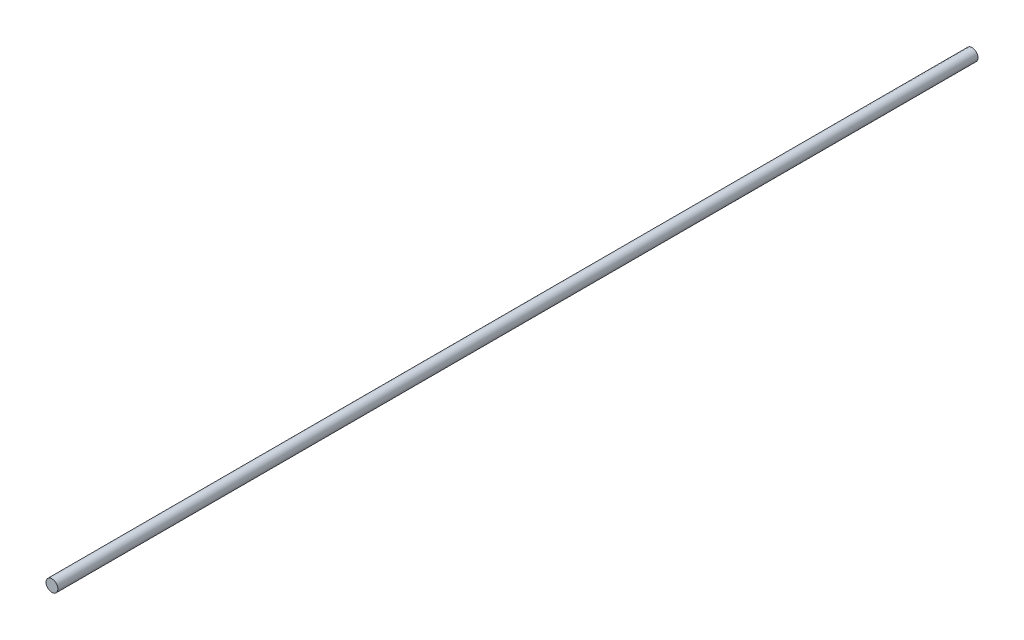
ISO-10303-21;
HEADER;
FILE_DESCRIPTION(('STEP AP214'),'2;1');
FILE_NAME('part.step','',(''),(''),'','','');
FILE_SCHEMA(('AUTOMOTIVE_DESIGN { 1 0 10303 214 1 1 1 1 }'));
ENDSEC;
DATA;
#1=APPLICATION_CONTEXT('core data for automotive mechanical design processes');
#2=APPLICATION_PROTOCOL_DEFINITION('international standard','automotive_design',2000,#1);
#3=PRODUCT_CONTEXT('',#1,'mechanical');
#4=PRODUCT('Part','Part','',(#3));
#5=PRODUCT_RELATED_PRODUCT_CATEGORY('part','',(#4));
#6=PRODUCT_DEFINITION_FORMATION('','',#4);
#7=PRODUCT_DEFINITION_CONTEXT('part definition',#1,'design');
#8=PRODUCT_DEFINITION('design','',#6,#7);
#9=PRODUCT_DEFINITION_SHAPE('','',#8);
#10=(LENGTH_UNIT() NAMED_UNIT(*) SI_UNIT(.MILLI.,.METRE.));
#11=(NAMED_UNIT(*) PLANE_ANGLE_UNIT() SI_UNIT($,.RADIAN.));
#12=(NAMED_UNIT(*) SI_UNIT($,.STERADIAN.) SOLID_ANGLE_UNIT());
#13=UNCERTAINTY_MEASURE_WITH_UNIT(LENGTH_MEASURE(1.E-05),#10,'distance_accuracy_value','');
#14=(GEOMETRIC_REPRESENTATION_CONTEXT(3) GLOBAL_UNCERTAINTY_ASSIGNED_CONTEXT((#13)) GLOBAL_UNIT_ASSIGNED_CONTEXT((#10,
#11,#12)) REPRESENTATION_CONTEXT('',''));
#15=CARTESIAN_POINT('',(0.,0.,0.));
#16=DIRECTION('',(0.,0.,1.));
#17=DIRECTION('',(1.,0.,0.));
#18=AXIS2_PLACEMENT_3D('',#15,#16,#17);
#19=CARTESIAN_POINT('',(0.,0.,-4650.));
#20=DIRECTION('',(0.,0.,1.));
#21=DIRECTION('',(1.,0.,0.));
#22=AXIS2_PLACEMENT_3D('',#19,#20,#21);
#23=CYLINDRICAL_SURFACE('',#22,30.);
#24=CARTESIAN_POINT('',(0.,0.,-4650.));
#25=DIRECTION('',(0.,0.,1.));
#26=DIRECTION('',(1.,0.,0.));
#27=AXIS2_PLACEMENT_3D('',#24,#25,#26);
#28=CIRCLE('',#27,30.);
#29=CARTESIAN_POINT('',(30.,0.,-4650.));
#30=VERTEX_POINT('',#29);
#31=EDGE_CURVE('E10',#30,#30,#28,.T.);
#32=ORIENTED_EDGE('',*,*,#31,.T.);
#33=EDGE_LOOP('',(#32));
#34=FACE_BOUND('',#33,.T.);
#35=CARTESIAN_POINT('',(0.,0.,0.));
#36=DIRECTION('',(0.,0.,1.));
#37=DIRECTION('',(1.,0.,0.));
#38=AXIS2_PLACEMENT_3D('',#35,#36,#37);
#39=CIRCLE('',#38,30.);
#40=CARTESIAN_POINT('',(30.,0.,0.));
#41=VERTEX_POINT('',#40);
#42=EDGE_CURVE('E40',#41,#41,#39,.T.);
#43=ORIENTED_EDGE('',*,*,#42,.F.);
#44=EDGE_LOOP('',(#43));
#45=FACE_BOUND('',#44,.T.);
#46=ADVANCED_FACE('F37',(#34,#45),#23,.T.);
#47=CARTESIAN_POINT('',(0.,0.,-4650.));
#48=DIRECTION('',(0.,0.,1.));
#49=DIRECTION('',(1.,0.,0.));
#50=AXIS2_PLACEMENT_3D('',#47,#48,#49);
#51=PLANE('',#50);
#52=ORIENTED_EDGE('',*,*,#31,.F.);
#53=EDGE_LOOP('',(#52));
#54=FACE_BOUND('',#53,.T.);
#55=ADVANCED_FACE('F54',(#54),#51,.F.);
#56=CARTESIAN_POINT('',(0.,0.,0.));
#57=DIRECTION('',(0.,0.,1.));
#58=DIRECTION('',(1.,0.,0.));
#59=AXIS2_PLACEMENT_3D('',#56,#57,#58);
#60=PLANE('',#59);
#61=ORIENTED_EDGE('',*,*,#42,.T.);
#62=EDGE_LOOP('',(#61));
#63=FACE_BOUND('',#62,.T.);
#64=ADVANCED_FACE('F51',(#63),#60,.T.);
#65=CLOSED_SHELL('',(#46,#55,#64));
#66=MANIFOLD_SOLID_BREP('B2',#65);
#67=ADVANCED_BREP_SHAPE_REPRESENTATION('',(#18,#66),#14);
#68=SHAPE_DEFINITION_REPRESENTATION(#9,#67);
ENDSEC;
END-ISO-10303-21;
